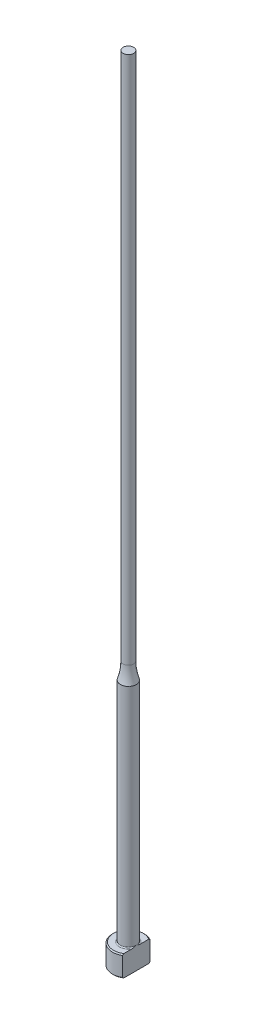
ISO-10303-21;
HEADER;
FILE_DESCRIPTION(('STEP AP214'),'2;1');
FILE_NAME('part.step','',(''),(''),'','','');
FILE_SCHEMA(('AUTOMOTIVE_DESIGN { 1 0 10303 214 1 1 1 1 }'));
ENDSEC;
DATA;
#1=APPLICATION_CONTEXT('core data for automotive mechanical design processes');
#2=APPLICATION_PROTOCOL_DEFINITION('international standard','automotive_design',2000,#1);
#3=PRODUCT_CONTEXT('',#1,'mechanical');
#4=PRODUCT('Part','Part','',(#3));
#5=PRODUCT_RELATED_PRODUCT_CATEGORY('part','',(#4));
#6=PRODUCT_DEFINITION_FORMATION('','',#4);
#7=PRODUCT_DEFINITION_CONTEXT('part definition',#1,'design');
#8=PRODUCT_DEFINITION('design','',#6,#7);
#9=PRODUCT_DEFINITION_SHAPE('','',#8);
#10=(LENGTH_UNIT() NAMED_UNIT(*) SI_UNIT(.MILLI.,.METRE.));
#11=(NAMED_UNIT(*) PLANE_ANGLE_UNIT() SI_UNIT($,.RADIAN.));
#12=(NAMED_UNIT(*) SI_UNIT($,.STERADIAN.) SOLID_ANGLE_UNIT());
#13=UNCERTAINTY_MEASURE_WITH_UNIT(LENGTH_MEASURE(1.E-05),#10,'distance_accuracy_value','');
#14=(GEOMETRIC_REPRESENTATION_CONTEXT(3) GLOBAL_UNCERTAINTY_ASSIGNED_CONTEXT((#13)) GLOBAL_UNIT_ASSIGNED_CONTEXT((#10,
#11,#12)) REPRESENTATION_CONTEXT('',''));
#15=CARTESIAN_POINT('',(0.,0.,0.));
#16=DIRECTION('',(0.,0.,1.));
#17=DIRECTION('',(1.,0.,0.));
#18=AXIS2_PLACEMENT_3D('',#15,#16,#17);
#19=CARTESIAN_POINT('',(-2.99999999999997,4.,0.));
#20=DIRECTION('',(0.,1.,0.));
#21=DIRECTION('',(0.,0.,1.));
#22=AXIS2_PLACEMENT_3D('',#19,#20,#21);
#23=PLANE('',#22);
#24=CARTESIAN_POINT('',(0.,4.,0.));
#25=DIRECTION('',(0.,1.,0.));
#26=DIRECTION('',(0.,0.,1.));
#27=AXIS2_PLACEMENT_3D('',#24,#25,#26);
#28=CIRCLE('',#27,2.79999999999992);
#29=CARTESIAN_POINT('',(1.49999999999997,4.,-2.3643180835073));
#30=VERTEX_POINT('',#29);
#31=CARTESIAN_POINT('',(1.49999999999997,4.,2.3643180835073));
#32=VERTEX_POINT('',#31);
#33=EDGE_CURVE('E187',#30,#32,#28,.T.);
#34=ORIENTED_EDGE('',*,*,#33,.T.);
#35=DIRECTION('',(0.,0.,-1.));
#36=VECTOR('',#35,1.);
#37=CARTESIAN_POINT('',(1.49999999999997,4.,0.));
#38=LINE('',#37,#36);
#39=CARTESIAN_POINT('',(1.49999999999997,3.99999999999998,0.799999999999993));
#40=VERTEX_POINT('',#39);
#41=EDGE_CURVE('E57',#32,#40,#38,.T.);
#42=ORIENTED_EDGE('',*,*,#41,.T.);
#43=CARTESIAN_POINT('',(0.,4.,0.));
#44=DIRECTION('',(0.,1.,0.));
#45=DIRECTION('',(0.,0.,1.));
#46=AXIS2_PLACEMENT_3D('',#43,#44,#45);
#47=CIRCLE('',#46,1.69999999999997);
#48=CARTESIAN_POINT('',(1.49999999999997,3.99999999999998,-0.799999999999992));
#49=VERTEX_POINT('',#48);
#50=EDGE_CURVE('E108',#40,#49,#47,.F.);
#51=ORIENTED_EDGE('',*,*,#50,.T.);
#52=EDGE_CURVE('E137',#49,#30,#38,.T.);
#53=ORIENTED_EDGE('',*,*,#52,.T.);
#54=EDGE_LOOP('',(#34,#42,#51,#53));
#55=FACE_BOUND('',#54,.T.);
#56=ADVANCED_FACE('F32',(#55),#23,.T.);
#57=CARTESIAN_POINT('',(0.,259.958771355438,0.));
#58=DIRECTION('',(0.,1.,0.));
#59=DIRECTION('',(0.,0.,1.));
#60=AXIS2_PLACEMENT_3D('',#57,#58,#59);
#61=CYLINDRICAL_SURFACE('',#60,2.99999999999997);
#62=CARTESIAN_POINT('',(0.,3.79999999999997,0.));
#63=DIRECTION('',(0.,1.,0.));
#64=DIRECTION('',(0.,0.,1.));
#65=AXIS2_PLACEMENT_3D('',#62,#63,#64);
#66=CIRCLE('',#65,2.99999999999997);
#67=CARTESIAN_POINT('',(1.49999999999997,3.79999999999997,2.5980762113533));
#68=VERTEX_POINT('',#67);
#69=CARTESIAN_POINT('',(1.49999999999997,3.79999999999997,-2.5980762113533));
#70=VERTEX_POINT('',#69);
#71=EDGE_CURVE('E105',#68,#70,#66,.F.);
#72=ORIENTED_EDGE('',*,*,#71,.T.);
#73=DIRECTION('',(0.,-1.,0.));
#74=VECTOR('',#73,1.);
#75=CARTESIAN_POINT('',(1.49999999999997,150.,-2.5980762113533));
#76=LINE('',#75,#74);
#77=CARTESIAN_POINT('',(1.49999999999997,0.199999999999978,-2.5980762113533));
#78=VERTEX_POINT('',#77);
#79=EDGE_CURVE('E193',#70,#78,#76,.T.);
#80=ORIENTED_EDGE('',*,*,#79,.T.);
#81=CARTESIAN_POINT('',(0.,0.199999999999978,0.));
#82=DIRECTION('',(0.,-1.,0.));
#83=DIRECTION('',(0.,0.,-1.));
#84=AXIS2_PLACEMENT_3D('',#81,#82,#83);
#85=CIRCLE('',#84,2.99999999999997);
#86=CARTESIAN_POINT('',(1.49999999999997,0.199999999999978,2.5980762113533));
#87=VERTEX_POINT('',#86);
#88=EDGE_CURVE('E100',#78,#87,#85,.F.);
#89=ORIENTED_EDGE('',*,*,#88,.T.);
#90=DIRECTION('',(0.,-1.,0.));
#91=VECTOR('',#90,1.);
#92=CARTESIAN_POINT('',(1.49999999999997,150.,2.5980762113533));
#93=LINE('',#92,#91);
#94=EDGE_CURVE('E93',#68,#87,#93,.T.);
#95=ORIENTED_EDGE('',*,*,#94,.F.);
#96=EDGE_LOOP('',(#72,#80,#89,#95));
#97=FACE_BOUND('',#96,.T.);
#98=ADVANCED_FACE('F158',(#97),#61,.T.);
#99=CARTESIAN_POINT('',(0.,0.,0.));
#100=DIRECTION('',(0.,-1.,0.));
#101=DIRECTION('',(0.,0.,-1.));
#102=AXIS2_PLACEMENT_3D('',#99,#100,#101);
#103=PLANE('',#102);
#104=CARTESIAN_POINT('',(0.,0.,0.));
#105=DIRECTION('',(0.,-1.,0.));
#106=DIRECTION('',(0.,0.,-1.));
#107=AXIS2_PLACEMENT_3D('',#104,#105,#106);
#108=CIRCLE('',#107,2.8);
#109=CARTESIAN_POINT('',(1.49999999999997,0.,2.36431808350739));
#110=VERTEX_POINT('',#109);
#111=CARTESIAN_POINT('',(1.49999999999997,0.,-2.36431808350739));
#112=VERTEX_POINT('',#111);
#113=EDGE_CURVE('E98',#110,#112,#108,.T.);
#114=ORIENTED_EDGE('',*,*,#113,.T.);
#115=DIRECTION('',(0.,0.,1.));
#116=VECTOR('',#115,1.);
#117=CARTESIAN_POINT('',(1.49999999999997,0.,2.5980762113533));
#118=LINE('',#117,#116);
#119=EDGE_CURVE('E83',#112,#110,#118,.T.);
#120=ORIENTED_EDGE('',*,*,#119,.T.);
#121=EDGE_LOOP('',(#114,#120));
#122=FACE_BOUND('',#121,.T.);
#123=ADVANCED_FACE('F103',(#122),#103,.T.);
#124=CARTESIAN_POINT('',(0.,4.,0.));
#125=DIRECTION('',(0.,-1.,0.));
#126=DIRECTION('',(0.,0.,-1.));
#127=AXIS2_PLACEMENT_3D('',#124,#125,#126);
#128=CONICAL_SURFACE('',#127,2.79999999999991,0.7853981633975);
#129=ORIENTED_EDGE('',*,*,#71,.F.);
#130=CARTESIAN_POINT('',(1.49999999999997,0.888258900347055,5.71827621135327));
#131=CARTESIAN_POINT('',(1.49999999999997,1.01361833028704,5.58866816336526));
#132=CARTESIAN_POINT('',(1.49999999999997,1.13884324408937,5.45892957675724));
#133=CARTESIAN_POINT('',(1.49999999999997,1.38894444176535,5.19911365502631));
#134=CARTESIAN_POINT('',(1.49999999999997,1.51382072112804,5.06903631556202));
#135=CARTESIAN_POINT('',(1.49999999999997,1.76320568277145,4.8084018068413));
#136=CARTESIAN_POINT('',(1.49999999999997,1.88771414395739,4.67784442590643));
#137=CARTESIAN_POINT('',(1.49999999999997,2.13618059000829,4.41620813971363));
#138=CARTESIAN_POINT('',(1.49999999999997,2.26013857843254,4.28512923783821));
#139=CARTESIAN_POINT('',(1.49999999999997,2.50488975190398,4.02490837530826));
#140=CARTESIAN_POINT('',(1.49999999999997,2.62569693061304,3.89577958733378));
#141=CARTESIAN_POINT('',(1.49999999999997,2.86640694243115,3.63668213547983));
#142=CARTESIAN_POINT('',(1.49999999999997,2.98630978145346,3.5067134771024));
#143=CARTESIAN_POINT('',(1.49999999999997,3.22486033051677,3.24567921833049));
#144=CARTESIAN_POINT('',(1.49999999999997,3.34350830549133,3.11461386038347));
#145=CARTESIAN_POINT('',(1.49999999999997,3.57907716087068,2.85094268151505));
#146=CARTESIAN_POINT('',(1.49999999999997,3.69599811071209,2.71833692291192));
#147=CARTESIAN_POINT('',(1.49999999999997,3.88262371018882,2.50255231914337));
#148=CARTESIAN_POINT('',(1.49999999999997,3.95312454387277,2.42006293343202));
#149=CARTESIAN_POINT('',(1.49999999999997,4.09287098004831,2.25401084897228));
#150=CARTESIAN_POINT('',(1.49999999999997,4.16211645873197,2.17044804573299));
#151=CARTESIAN_POINT('',(1.49999999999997,4.29964684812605,2.00105967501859));
#152=CARTESIAN_POINT('',(1.49999999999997,4.36791386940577,1.91521952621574));
#153=CARTESIAN_POINT('',(1.49999999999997,4.50205840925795,1.74171392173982));
#154=CARTESIAN_POINT('',(1.49999999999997,4.56793649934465,1.65404891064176));
#155=CARTESIAN_POINT('',(1.49999999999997,4.69728151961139,1.47490236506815));
#156=CARTESIAN_POINT('',(1.49999999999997,4.76069661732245,1.38338308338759));
#157=CARTESIAN_POINT('',(1.49999999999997,4.88239539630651,1.1967566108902));
#158=CARTESIAN_POINT('',(1.49999999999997,4.9406720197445,1.10164473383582));
#159=CARTESIAN_POINT('',(1.49999999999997,5.04841325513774,0.908008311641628));
#160=CARTESIAN_POINT('',(1.49999999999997,5.09797809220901,0.809540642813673));
#161=CARTESIAN_POINT('',(1.49999999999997,5.18432188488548,0.607192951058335));
#162=CARTESIAN_POINT('',(1.49999999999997,5.22114374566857,0.503332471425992));
#163=CARTESIAN_POINT('',(1.49999999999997,5.26099935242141,0.347577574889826));
#164=CARTESIAN_POINT('',(1.49999999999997,5.27157029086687,0.297609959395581));
#165=CARTESIAN_POINT('',(1.49999999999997,5.28794860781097,0.196885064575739));
#166=CARTESIAN_POINT('',(1.49999999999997,5.29375640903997,0.146127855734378));
#167=CARTESIAN_POINT('',(1.49999999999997,5.3001970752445,0.0444388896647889));
#168=CARTESIAN_POINT('',(1.49999999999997,5.3008459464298,-0.00649183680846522));
#169=CARTESIAN_POINT('',(1.49999999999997,5.29696416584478,-0.108155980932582));
#170=CARTESIAN_POINT('',(1.49999999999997,5.29243308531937,-0.158889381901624));
#171=CARTESIAN_POINT('',(1.49999999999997,5.2785691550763,-0.259234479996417));
#172=CARTESIAN_POINT('',(1.49999999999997,5.2692782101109,-0.308852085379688));
#173=CARTESIAN_POINT('',(1.49999999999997,5.24647108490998,-0.40711049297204));
#174=CARTESIAN_POINT('',(1.49999999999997,5.23295324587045,-0.455750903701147));
#175=CARTESIAN_POINT('',(1.49999999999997,5.20226175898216,-0.552149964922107));
#176=CARTESIAN_POINT('',(1.49999999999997,5.18506801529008,-0.5999021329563));
#177=CARTESIAN_POINT('',(1.49999999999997,5.14771387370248,-0.694205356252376));
#178=CARTESIAN_POINT('',(1.49999999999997,5.12755408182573,-0.740756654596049));
#179=CARTESIAN_POINT('',(1.49999999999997,5.06327696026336,-0.879166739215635));
#180=CARTESIAN_POINT('',(1.49999999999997,5.01551721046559,-0.969329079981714));
#181=CARTESIAN_POINT('',(1.49999999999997,4.91367909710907,-1.1460431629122));
#182=CARTESIAN_POINT('',(1.49999999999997,4.85959300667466,-1.23259031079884));
#183=CARTESIAN_POINT('',(1.49999999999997,4.74697968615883,-1.40321348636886));
#184=CARTESIAN_POINT('',(1.49999999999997,4.68843573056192,-1.48727838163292));
#185=CARTESIAN_POINT('',(1.49999999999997,4.56843845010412,-1.6532218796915));
#186=CARTESIAN_POINT('',(1.49999999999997,4.50698656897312,-1.73510153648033));
#187=CARTESIAN_POINT('',(1.49999999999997,4.38115673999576,-1.89829823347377));
#188=CARTESIAN_POINT('',(1.49999999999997,4.31675092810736,-1.9795936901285));
#189=CARTESIAN_POINT('',(1.49999999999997,4.18634068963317,-2.14090082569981));
#190=CARTESIAN_POINT('',(1.49999999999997,4.12033609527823,-2.22091236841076));
#191=CARTESIAN_POINT('',(1.49999999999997,3.92086431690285,-2.45906508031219));
#192=CARTESIAN_POINT('',(1.49999999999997,3.78562663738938,-2.61572090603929));
#193=CARTESIAN_POINT('',(1.49999999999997,3.53554498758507,-2.90006295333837));
#194=CARTESIAN_POINT('',(1.49999999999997,3.42114543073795,-3.02814382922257));
#195=CARTESIAN_POINT('',(1.49999999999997,3.19093557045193,-3.28303767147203));
#196=CARTESIAN_POINT('',(1.49999999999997,3.07512522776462,-3.40985060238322));
#197=CARTESIAN_POINT('',(1.49999999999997,2.72597067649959,-3.78913849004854));
#198=CARTESIAN_POINT('',(1.49999999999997,2.49111760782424,-4.04022177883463));
#199=CARTESIAN_POINT('',(1.49999999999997,2.02882478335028,-4.52992803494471));
#200=CARTESIAN_POINT('',(1.49999999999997,1.80147747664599,-4.76863870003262));
#201=CARTESIAN_POINT('',(1.49999999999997,1.45954865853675,-5.12558036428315));
#202=CARTESIAN_POINT('',(1.49999999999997,1.34548484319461,-5.24430773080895));
#203=CARTESIAN_POINT('',(1.49999999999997,1.11707176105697,-5.48148573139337));
#204=CARTESIAN_POINT('',(1.49999999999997,1.00272249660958,-5.59993636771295));
#205=CARTESIAN_POINT('',(1.49999999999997,0.888258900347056,-5.71827621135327));
#206=B_SPLINE_CURVE_WITH_KNOTS('',3,(#130,#131,#132,#133,#134,#135,#136,#137,#138,#139,#140,
#141,#142,#143,#144,#145,#146,#147,#148,#149,#150,#151,#152,#153,#154,#155,#156,#157,#158,#159,
#160,#161,#162,#163,#164,#165,#166,#167,#168,#169,#170,#171,#172,#173,#174,#175,#176,#177,#178,
#179,#180,#181,#182,#183,#184,#185,#186,#187,#188,#189,#190,#191,#192,#193,#194,#195,#196,#197,
#198,#199,#200,#201,#202,#203,#204,#205),.UNSPECIFIED.,.F.,.F.,(4,2,2,2,2,2,2,2,2,2,2,2,2,2,2,2,
2,2,2,2,2,2,2,2,2,2,2,2,2,2,2,2,2,2,2,2,2,4),(0.,0.540943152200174,1.08189327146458,
1.62312052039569,2.16434426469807,2.69482920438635,3.22531067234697,3.75567781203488,
4.28602356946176,4.61155053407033,4.93710943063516,5.26610945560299,5.59503024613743,
5.92894782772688,6.26331713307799,6.59354403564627,6.92264800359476,7.07567478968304,
7.22868799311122,7.38122626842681,7.53377717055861,7.68500755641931,7.83629736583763,
7.98843643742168,8.14054446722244,8.4461879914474,8.75220879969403,9.05944044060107,
9.366521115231,9.677642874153,9.98879742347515,10.6095925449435,11.1247803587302,
11.6399825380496,12.6713544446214,13.6603005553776,14.1542238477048,14.648143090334),.UNSPECIFIED.);
#207=EDGE_CURVE('E136',#68,#32,#206,.T.);
#208=ORIENTED_EDGE('',*,*,#207,.T.);
#209=ORIENTED_EDGE('',*,*,#33,.F.);
#210=EDGE_CURVE('E128',#30,#70,#206,.T.);
#211=ORIENTED_EDGE('',*,*,#210,.T.);
#212=EDGE_LOOP('',(#129,#208,#209,#211));
#213=FACE_BOUND('',#212,.T.);
#214=ADVANCED_FACE('F144',(#213),#128,.T.);
#215=CARTESIAN_POINT('',(0.,0.199999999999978,0.));
#216=DIRECTION('',(0.,1.,0.));
#217=DIRECTION('',(0.,0.,1.));
#218=AXIS2_PLACEMENT_3D('',#215,#216,#217);
#219=CONICAL_SURFACE('',#218,2.99999999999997,0.785398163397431);
#220=ORIENTED_EDGE('',*,*,#88,.F.);
#221=CARTESIAN_POINT('',(1.49999999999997,3.1117410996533,-5.71827621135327));
#222=CARTESIAN_POINT('',(1.49999999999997,2.98638166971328,-5.58866816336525));
#223=CARTESIAN_POINT('',(1.49999999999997,2.86115675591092,-5.45892957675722));
#224=CARTESIAN_POINT('',(1.49999999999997,2.61105555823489,-5.19911365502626));
#225=CARTESIAN_POINT('',(1.49999999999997,2.48617927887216,-5.06903631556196));
#226=CARTESIAN_POINT('',(1.49999999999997,2.23679431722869,-4.80840180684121));
#227=CARTESIAN_POINT('',(1.49999999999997,2.11228585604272,-4.67784442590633));
#228=CARTESIAN_POINT('',(1.49999999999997,1.86381940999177,-4.4162081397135));
#229=CARTESIAN_POINT('',(1.49999999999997,1.73986142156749,-4.28512923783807));
#230=CARTESIAN_POINT('',(1.49999999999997,1.49511024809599,-4.02490837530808));
#231=CARTESIAN_POINT('',(1.49999999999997,1.3743030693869,-3.8957795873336));
#232=CARTESIAN_POINT('',(1.49999999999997,1.13359305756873,-3.63668213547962));
#233=CARTESIAN_POINT('',(1.49999999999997,1.0136902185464,-3.50671347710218));
#234=CARTESIAN_POINT('',(1.49999999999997,0.77513966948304,-3.24567921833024));
#235=CARTESIAN_POINT('',(1.49999999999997,0.656491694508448,-3.11461386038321));
#236=CARTESIAN_POINT('',(1.49999999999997,0.420922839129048,-2.85094268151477));
#237=CARTESIAN_POINT('',(1.49999999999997,0.30400188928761,-2.71833692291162));
#238=CARTESIAN_POINT('',(1.49999999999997,0.11737628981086,-2.50255231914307));
#239=CARTESIAN_POINT('',(1.49999999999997,0.046875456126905,-2.42006293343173));
#240=CARTESIAN_POINT('',(1.49999999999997,-0.0928709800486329,-2.254010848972));
#241=CARTESIAN_POINT('',(1.49999999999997,-0.162116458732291,-2.17044804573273));
#242=CARTESIAN_POINT('',(1.49999999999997,-0.299646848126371,-2.00105967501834));
#243=CARTESIAN_POINT('',(1.49999999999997,-0.367913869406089,-1.9152195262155));
#244=CARTESIAN_POINT('',(1.49999999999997,-0.502058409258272,-1.7417139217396));
#245=CARTESIAN_POINT('',(1.49999999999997,-0.567936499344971,-1.65404891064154));
#246=CARTESIAN_POINT('',(1.49999999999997,-0.697281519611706,-1.47490236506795));
#247=CARTESIAN_POINT('',(1.49999999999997,-0.76069661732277,-1.38338308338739));
#248=CARTESIAN_POINT('',(1.49999999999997,-0.882395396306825,-1.19675661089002));
#249=CARTESIAN_POINT('',(1.49999999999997,-0.940672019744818,-1.10164473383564));
#250=CARTESIAN_POINT('',(1.49999999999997,-1.04841325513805,-0.908008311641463));
#251=CARTESIAN_POINT('',(1.49999999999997,-1.09797809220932,-0.809540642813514));
#252=CARTESIAN_POINT('',(1.49999999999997,-1.18432188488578,-0.607192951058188));
#253=CARTESIAN_POINT('',(1.49999999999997,-1.22114374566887,-0.50333247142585));
#254=CARTESIAN_POINT('',(1.49999999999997,-1.26099935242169,-0.347577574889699));
#255=CARTESIAN_POINT('',(1.49999999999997,-1.27157029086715,-0.297609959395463));
#256=CARTESIAN_POINT('',(1.49999999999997,-1.28794860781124,-0.196885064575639));
#257=CARTESIAN_POINT('',(1.49999999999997,-1.29375640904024,-0.146127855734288));
#258=CARTESIAN_POINT('',(1.49999999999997,-1.30019707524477,-0.0444388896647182));
#259=CARTESIAN_POINT('',(1.49999999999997,-1.30084594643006,0.00649183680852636));
#260=CARTESIAN_POINT('',(1.49999999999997,-1.29696416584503,0.108155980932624));
#261=CARTESIAN_POINT('',(1.49999999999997,-1.29243308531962,0.158889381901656));
#262=CARTESIAN_POINT('',(1.49999999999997,-1.27856915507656,0.25923447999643));
#263=CARTESIAN_POINT('',(1.49999999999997,-1.26927821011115,0.308852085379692));
#264=CARTESIAN_POINT('',(1.49999999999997,-1.24647108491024,0.407110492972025));
#265=CARTESIAN_POINT('',(1.49999999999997,-1.2329532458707,0.455750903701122));
#266=CARTESIAN_POINT('',(1.49999999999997,-1.20226175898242,0.552149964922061));
#267=CARTESIAN_POINT('',(1.49999999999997,-1.18506801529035,0.599902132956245));
#268=CARTESIAN_POINT('',(1.49999999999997,-1.14771387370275,0.694205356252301));
#269=CARTESIAN_POINT('',(1.49999999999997,-1.12755408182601,0.740756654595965));
#270=CARTESIAN_POINT('',(1.49999999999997,-1.06327696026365,0.879166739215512));
#271=CARTESIAN_POINT('',(1.49999999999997,-1.0155172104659,0.969329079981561));
#272=CARTESIAN_POINT('',(1.49999999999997,-0.913679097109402,1.14604316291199));
#273=CARTESIAN_POINT('',(1.49999999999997,-0.859593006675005,1.2325903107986));
#274=CARTESIAN_POINT('',(1.49999999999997,-0.746979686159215,1.40321348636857));
#275=CARTESIAN_POINT('',(1.49999999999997,-0.688435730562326,1.4872783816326));
#276=CARTESIAN_POINT('',(1.49999999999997,-0.568438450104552,1.65322187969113));
#277=CARTESIAN_POINT('',(1.49999999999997,-0.506986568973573,1.73510153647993));
#278=CARTESIAN_POINT('',(1.49999999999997,-0.381156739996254,1.89829823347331));
#279=CARTESIAN_POINT('',(1.49999999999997,-0.316750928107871,1.97959369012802));
#280=CARTESIAN_POINT('',(1.49999999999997,-0.18634068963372,2.14090082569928));
#281=CARTESIAN_POINT('',(1.49999999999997,-0.120336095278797,2.22091236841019));
#282=CARTESIAN_POINT('',(1.49999999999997,0.0791356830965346,2.45906508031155));
#283=CARTESIAN_POINT('',(1.49999999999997,0.214373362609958,2.61572090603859));
#284=CARTESIAN_POINT('',(1.49999999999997,0.464455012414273,2.90006295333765));
#285=CARTESIAN_POINT('',(1.49999999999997,0.578854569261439,3.02814382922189));
#286=CARTESIAN_POINT('',(1.49999999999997,0.809064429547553,3.28303767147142));
#287=CARTESIAN_POINT('',(1.49999999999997,0.924874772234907,3.40985060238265));
#288=CARTESIAN_POINT('',(1.49999999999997,1.27402932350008,3.78913849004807));
#289=CARTESIAN_POINT('',(1.49999999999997,1.50888239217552,4.04022177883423));
#290=CARTESIAN_POINT('',(1.49999999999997,1.97117521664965,4.52992803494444));
#291=CARTESIAN_POINT('',(1.49999999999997,2.19852252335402,4.76863870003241));
#292=CARTESIAN_POINT('',(1.49999999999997,2.54045134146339,5.12558036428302));
#293=CARTESIAN_POINT('',(1.49999999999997,2.65451515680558,5.24430773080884));
#294=CARTESIAN_POINT('',(1.49999999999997,2.8829282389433,5.48148573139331));
#295=CARTESIAN_POINT('',(1.49999999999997,2.99727750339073,5.59993636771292));
#296=CARTESIAN_POINT('',(1.49999999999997,3.1117410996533,5.71827621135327));
#297=B_SPLINE_CURVE_WITH_KNOTS('',3,(#221,#222,#223,#224,#225,#226,#227,#228,#229,#230,#231,
#232,#233,#234,#235,#236,#237,#238,#239,#240,#241,#242,#243,#244,#245,#246,#247,#248,#249,#250,
#251,#252,#253,#254,#255,#256,#257,#258,#259,#260,#261,#262,#263,#264,#265,#266,#267,#268,#269,
#270,#271,#272,#273,#274,#275,#276,#277,#278,#279,#280,#281,#282,#283,#284,#285,#286,#287,#288,
#289,#290,#291,#292,#293,#294,#295,#296),.UNSPECIFIED.,.F.,.F.,(4,2,2,2,2,2,2,2,2,2,2,2,2,2,2,2,
2,2,2,2,2,2,2,2,2,2,2,2,2,2,2,2,2,2,2,2,2,4),(0.,0.540943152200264,1.08189327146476,
1.62312052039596,2.16434426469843,2.69482920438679,3.22531067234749,3.75567781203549,
4.28602356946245,4.611550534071,4.9371094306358,5.26610945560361,5.59503024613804,
5.92894782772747,6.26331713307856,6.59354403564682,6.92264800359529,7.07567478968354,
7.22868799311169,7.38122626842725,7.53377717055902,7.6850075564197,7.83629736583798,
7.98843643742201,8.14054446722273,8.44618799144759,8.75220879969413,9.05944044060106,
9.3665211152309,9.6776428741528,9.98879742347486,10.609592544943,11.1247803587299,
11.6399825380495,12.6713544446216,13.6603005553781,14.1542238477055,14.6481430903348),.UNSPECIFIED.);
#298=EDGE_CURVE('E86',#78,#112,#297,.T.);
#299=ORIENTED_EDGE('',*,*,#298,.T.);
#300=ORIENTED_EDGE('',*,*,#113,.F.);
#301=EDGE_CURVE('E89',#110,#87,#297,.T.);
#302=ORIENTED_EDGE('',*,*,#301,.T.);
#303=EDGE_LOOP('',(#220,#299,#300,#302));
#304=FACE_BOUND('',#303,.T.);
#305=ADVANCED_FACE('F97',(#304),#219,.T.);
#306=CARTESIAN_POINT('',(0.,4.19999999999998,0.));
#307=DIRECTION('',(0.,1.,0.));
#308=DIRECTION('',(0.,0.,1.));
#309=AXIS2_PLACEMENT_3D('',#306,#307,#308);
#310=TOROIDAL_SURFACE('',#309,1.69999999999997,0.2);
#311=CARTESIAN_POINT('',(1.49999999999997,4.19999999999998,0.));
#312=CARTESIAN_POINT('',(1.49999999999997,4.20000050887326,7.14686674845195E-11));
#313=CARTESIAN_POINT('',(1.49999999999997,4.20000101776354,-1.21663673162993E-07));
#314=CARTESIAN_POINT('',(1.49999999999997,4.20000199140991,-4.97616237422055E-07));
#315=CARTESIAN_POINT('',(1.49999999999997,4.20000245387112,-7.56516220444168E-07));
#316=CARTESIAN_POINT('',(1.49999999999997,4.20000338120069,-1.37642837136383E-06));
#317=CARTESIAN_POINT('',(1.49999999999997,4.20000384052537,-1.74563476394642E-06));
#318=CARTESIAN_POINT('',(1.49999999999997,4.20000469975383,-2.53565984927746E-06));
#319=CARTESIAN_POINT('',(1.49999999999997,4.20000510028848,-2.95582597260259E-06));
#320=CARTESIAN_POINT('',(1.49999999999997,4.20000646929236,-4.48430445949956E-06));
#321=CARTESIAN_POINT('',(1.49999999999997,4.20000736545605,-5.6586103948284E-06));
#322=CARTESIAN_POINT('',(1.49999999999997,4.20000893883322,-8.06479202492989E-06));
#323=CARTESIAN_POINT('',(1.49999999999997,4.20000962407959,-9.29170517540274E-06));
#324=CARTESIAN_POINT('',(1.49999999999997,4.20001225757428,-1.416232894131E-05));
#325=CARTESIAN_POINT('',(1.49999999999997,4.20001407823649,-1.78790031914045E-05));
#326=CARTESIAN_POINT('',(1.49999999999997,4.20001699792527,-2.51443066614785E-05));
#327=CARTESIAN_POINT('',(1.49999999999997,4.20001815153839,-2.86715394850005E-05));
#328=CARTESIAN_POINT('',(1.49999999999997,4.20002315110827,-4.39218128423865E-05));
#329=CARTESIAN_POINT('',(1.49999999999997,4.20002701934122,-5.56288390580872E-05));
#330=CARTESIAN_POINT('',(1.49999999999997,4.20003312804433,-7.7405829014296E-05));
#331=CARTESIAN_POINT('',(1.49999999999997,4.20003553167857,-8.74278412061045E-05));
#332=CARTESIAN_POINT('',(1.49999999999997,4.20005483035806,-0.000161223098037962));
#333=CARTESIAN_POINT('',(1.49999999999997,4.20007979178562,-0.000222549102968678));
#334=CARTESIAN_POINT('',(1.49999999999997,4.20017391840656,-0.000462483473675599));
#335=CARTESIAN_POINT('',(1.49999999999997,4.20023706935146,-0.000642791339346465));
#336=CARTESIAN_POINT('',(1.49999999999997,4.20048761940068,-0.00134785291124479));
#337=CARTESIAN_POINT('',(1.49999999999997,4.20068132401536,-0.00187087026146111));
#338=CARTESIAN_POINT('',(1.49999999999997,4.20147357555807,-0.00402004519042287));
#339=CARTESIAN_POINT('',(1.49999999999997,4.20206499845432,-0.0056481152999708));
#340=CARTESIAN_POINT('',(1.49999999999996,4.20892634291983,-0.0245232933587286));
#341=CARTESIAN_POINT('',(1.49999999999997,4.21523683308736,-0.041759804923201));
#342=CARTESIAN_POINT('',(1.49999999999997,4.22755028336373,-0.0756091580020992));
#343=CARTESIAN_POINT('',(1.49999999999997,4.23355589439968,-0.0922211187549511));
#344=CARTESIAN_POINT('',(1.49999999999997,4.24620101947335,-0.127454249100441));
#345=CARTESIAN_POINT('',(1.49999999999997,4.25283080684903,-0.146078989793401));
#346=CARTESIAN_POINT('',(1.49999999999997,4.26599765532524,-0.183577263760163));
#347=CARTESIAN_POINT('',(1.49999999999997,4.27253305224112,-0.202451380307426));
#348=CARTESIAN_POINT('',(1.49999999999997,4.28834228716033,-0.248982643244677));
#349=CARTESIAN_POINT('',(1.49999999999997,4.2974915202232,-0.276682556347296));
#350=CARTESIAN_POINT('',(1.49999999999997,4.31490935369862,-0.331625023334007));
#351=CARTESIAN_POINT('',(1.49999999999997,4.3231938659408,-0.358862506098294));
#352=CARTESIAN_POINT('',(1.49999999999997,4.34051594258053,-0.419125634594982));
#353=CARTESIAN_POINT('',(1.49999999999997,4.34936607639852,-0.452206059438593));
#354=CARTESIAN_POINT('',(1.49999999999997,4.36549583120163,-0.519023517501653));
#355=CARTESIAN_POINT('',(1.49999999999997,4.37276283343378,-0.552763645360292));
#356=CARTESIAN_POINT('',(1.49999999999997,4.38554755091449,-0.62305310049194));
#357=CARTESIAN_POINT('',(1.49999999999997,4.39090573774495,-0.65963271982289));
#358=CARTESIAN_POINT('',(1.49999999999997,4.39825016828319,-0.733028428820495));
#359=CARTESIAN_POINT('',(1.49999999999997,4.40024734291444,-0.76984335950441));
#360=CARTESIAN_POINT('',(1.49999999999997,4.39970780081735,-0.842856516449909));
#361=CARTESIAN_POINT('',(1.49999999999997,4.39725347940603,-0.879053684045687));
#362=CARTESIAN_POINT('',(1.49999999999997,4.38900085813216,-0.93238076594));
#363=CARTESIAN_POINT('',(1.49999999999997,4.38553049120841,-0.949868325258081));
#364=CARTESIAN_POINT('',(1.49999999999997,4.37678336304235,-0.984374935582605));
#365=CARTESIAN_POINT('',(1.49999999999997,4.37150943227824,-1.00139467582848));
#366=CARTESIAN_POINT('',(1.49999999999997,4.35869781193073,-1.03479423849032));
#367=CARTESIAN_POINT('',(1.49999999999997,4.3511359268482,-1.05116499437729));
#368=CARTESIAN_POINT('',(1.49999999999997,4.33325333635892,-1.08234828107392));
#369=CARTESIAN_POINT('',(1.49999999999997,4.32294266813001,-1.09716621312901));
#370=CARTESIAN_POINT('',(1.49999999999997,4.30512758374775,-1.11714173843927));
#371=CARTESIAN_POINT('',(1.49999999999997,4.29884721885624,-1.12339066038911));
#372=CARTESIAN_POINT('',(1.49999999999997,4.28545950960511,-1.13494695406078));
#373=CARTESIAN_POINT('',(1.49999999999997,4.27835226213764,-1.14025443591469));
#374=CARTESIAN_POINT('',(1.49999999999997,4.26325970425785,-1.14967631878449));
#375=CARTESIAN_POINT('',(1.49999999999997,4.25526534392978,-1.15377649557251));
#376=CARTESIAN_POINT('',(1.49999999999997,4.23863207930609,-1.16034952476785));
#377=CARTESIAN_POINT('',(1.49999999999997,4.22999427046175,-1.16282507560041));
#378=CARTESIAN_POINT('',(1.49999999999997,4.21343922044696,-1.16570267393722));
#379=CARTESIAN_POINT('',(1.49999999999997,4.20555896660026,-1.16631687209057));
#380=CARTESIAN_POINT('',(1.49999999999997,4.18982775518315,-1.16602054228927));
#381=CARTESIAN_POINT('',(1.49999999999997,4.18197679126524,-1.16511036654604));
#382=CARTESIAN_POINT('',(1.49999999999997,4.16747846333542,-1.16204446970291));
#383=CARTESIAN_POINT('',(1.49999999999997,4.16079696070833,-1.16004509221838));
#384=CARTESIAN_POINT('',(1.49999999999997,4.14781700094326,-1.15505972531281));
#385=CARTESIAN_POINT('',(1.49999999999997,4.14151862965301,-1.1520735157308));
#386=CARTESIAN_POINT('',(1.49999999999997,4.12690214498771,-1.14387585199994));
#387=CARTESIAN_POINT('',(1.49999999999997,4.11881436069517,-1.13825400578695));
#388=CARTESIAN_POINT('',(1.49999999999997,4.1036444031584,-1.12578441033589));
#389=CARTESIAN_POINT('',(1.49999999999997,4.09656475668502,-1.11893367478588));
#390=CARTESIAN_POINT('',(1.49999999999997,4.08012297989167,-1.10074342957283));
#391=CARTESIAN_POINT('',(1.49999999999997,4.07136543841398,-1.08886044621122));
#392=CARTESIAN_POINT('',(1.49999999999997,4.05578194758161,-1.06392743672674));
#393=CARTESIAN_POINT('',(1.49999999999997,4.0489571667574,-1.05087671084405));
#394=CARTESIAN_POINT('',(1.49999999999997,4.03273856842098,-1.01472307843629));
#395=CARTESIAN_POINT('',(1.49999999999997,4.02486230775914,-0.990945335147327));
#396=CARTESIAN_POINT('',(1.49999999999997,4.01257693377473,-0.94232199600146));
#397=CARTESIAN_POINT('',(1.49999999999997,4.00820590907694,-0.917467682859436));
#398=CARTESIAN_POINT('',(1.49999999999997,4.00229956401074,-0.867912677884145));
#399=CARTESIAN_POINT('',(1.49999999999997,4.0007128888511,-0.843217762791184));
#400=CARTESIAN_POINT('',(1.49999999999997,3.9996723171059,-0.79374605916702));
#401=CARTESIAN_POINT('',(1.49999999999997,4.0002230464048,-0.768969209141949));
#402=CARTESIAN_POINT('',(1.49999999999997,4.00433101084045,-0.696994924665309));
#403=CARTESIAN_POINT('',(1.49999999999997,4.01016976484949,-0.64993124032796));
#404=CARTESIAN_POINT('',(1.49999999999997,4.02567776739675,-0.559166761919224));
#405=CARTESIAN_POINT('',(1.49999999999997,4.03511950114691,-0.515423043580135));
#406=CARTESIAN_POINT('',(1.49999999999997,4.05693059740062,-0.427590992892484));
#407=CARTESIAN_POINT('',(1.49999999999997,4.06936356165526,-0.383518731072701));
#408=CARTESIAN_POINT('',(1.49999999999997,4.09174953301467,-0.310161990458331));
#409=CARTESIAN_POINT('',(1.49999999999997,4.10119843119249,-0.280718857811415));
#410=CARTESIAN_POINT('',(1.49999999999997,4.12060442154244,-0.22234098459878));
#411=CARTESIAN_POINT('',(1.49999999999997,4.13055519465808,-0.193404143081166));
#412=CARTESIAN_POINT('',(1.49999999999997,4.14973721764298,-0.138756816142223));
#413=CARTESIAN_POINT('',(1.49999999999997,4.15893123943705,-0.113033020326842));
#414=CARTESIAN_POINT('',(1.49999999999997,4.17788037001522,-0.0606351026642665));
#415=CARTESIAN_POINT('',(1.49999999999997,4.18764328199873,-0.0339636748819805));
#416=CARTESIAN_POINT('',(1.49999999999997,4.19793548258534,-0.00564657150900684));
#417=CARTESIAN_POINT('',(1.49999999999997,4.19852751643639,-0.00401699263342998));
#418=CARTESIAN_POINT('',(1.49999999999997,4.1993199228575,-0.0018674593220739));
#419=CARTESIAN_POINT('',(1.49999999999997,4.19951319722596,-0.00134559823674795));
#420=CARTESIAN_POINT('',(1.49999999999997,4.19976322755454,-0.000641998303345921));
#421=CARTESIAN_POINT('',(1.49999999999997,4.19982627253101,-0.000461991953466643));
#422=CARTESIAN_POINT('',(1.49999999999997,4.19992025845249,-0.000222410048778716));
#423=CARTESIAN_POINT('',(1.49999999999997,4.19994519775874,-0.000161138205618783));
#424=CARTESIAN_POINT('',(1.49999999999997,4.19996448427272,-8.74039267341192E-05));
#425=CARTESIAN_POINT('',(1.49999999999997,4.19996688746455,-7.73857556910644E-05));
#426=CARTESIAN_POINT('',(1.49999999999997,4.1999729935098,-5.56173272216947E-05));
#427=CARTESIAN_POINT('',(1.49999999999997,4.19997685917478,-4.39149186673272E-05));
#428=CARTESIAN_POINT('',(1.49999999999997,4.19998185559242,-2.86698156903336E-05));
#429=CARTESIAN_POINT('',(1.49999999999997,4.19998300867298,-2.51431575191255E-05));
#430=CARTESIAN_POINT('',(1.49999999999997,4.19998592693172,-1.78789552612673E-05));
#431=CARTESIAN_POINT('',(1.49999999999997,4.19998774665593,-1.41627846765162E-05));
#432=CARTESIAN_POINT('',(1.49999999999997,4.19999037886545,-9.29264488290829E-06));
#433=CARTESIAN_POINT('',(1.49999999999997,4.19999106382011,-8.06577599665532E-06));
#434=CARTESIAN_POINT('',(1.49999999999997,4.19999263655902,-5.65962639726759E-06));
#435=CARTESIAN_POINT('',(1.49999999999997,4.19999353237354,-4.48530466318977E-06));
#436=CARTESIAN_POINT('',(1.49999999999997,4.19999490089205,-2.95673740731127E-06));
#437=CARTESIAN_POINT('',(1.49999999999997,4.1999953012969,-2.53653208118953E-06));
#438=CARTESIAN_POINT('',(1.49999999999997,4.19999616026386,-1.74640525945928E-06));
#439=CARTESIAN_POINT('',(1.49999999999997,4.19999661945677,-1.37713598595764E-06));
#440=CARTESIAN_POINT('',(1.49999999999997,4.19999754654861,-7.57072336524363E-07));
#441=CARTESIAN_POINT('',(1.49999999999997,4.19999800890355,-4.9808738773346E-07));
#442=CARTESIAN_POINT('',(1.49999999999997,4.19999898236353,-1.21927249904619E-07));
#443=CARTESIAN_POINT('',(1.49999999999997,4.19999949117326,-7.14621294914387E-11));
#444=CARTESIAN_POINT('',(1.49999999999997,4.19999999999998,0.));
#445=B_SPLINE_CURVE_WITH_KNOTS('',3,(#311,#312,#313,#314,#315,#316,#317,#318,#319,#320,#321,
#322,#323,#324,#325,#326,#327,#328,#329,#330,#331,#332,#333,#334,#335,#336,#337,#338,#339,#340,
#341,#342,#343,#344,#345,#346,#347,#348,#349,#350,#351,#352,#353,#354,#355,#356,#357,#358,#359,
#360,#361,#362,#363,#364,#365,#366,#367,#368,#369,#370,#371,#372,#373,#374,#375,#376,#377,#378,
#379,#380,#381,#382,#383,#384,#385,#386,#387,#388,#389,#390,#391,#392,#393,#394,#395,#396,#397,
#398,#399,#400,#401,#402,#403,#404,#405,#406,#407,#408,#409,#410,#411,#412,#413,#414,#415,#416,
#417,#418,#419,#420,#421,#422,#423,#424,#425,#426,#427,#428,#429,#430,#431,#432,#433,#434,#435,
#436,#437,#438,#439,#440,#441,#442,#443,#444),.UNSPECIFIED.,.T.,.F.,(4,2,2,2,2,2,2,2,2,2,2,2,2,
2,2,2,2,2,2,2,2,2,2,2,2,2,2,2,2,2,2,2,2,2,2,2,2,2,2,2,2,2,2,2,2,2,2,2,2,2,2,2,2,2,2,2,2,2,2,2,2,
2,2,2,2,2,4),(0.,1.5268750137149E-06,3.10959387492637E-06,4.86976756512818E-06,
6.60940084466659E-06,1.10202525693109E-05,1.5232779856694E-05,2.7614037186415E-05,
3.87351645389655E-05,7.57188332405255E-05,0.000106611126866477,0.000304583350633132,
0.00087827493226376,0.00255078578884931,0.0077480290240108,0.0628090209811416,0.115802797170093,
0.175110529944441,0.23503061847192,0.32253950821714,0.407938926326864,0.510638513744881,
0.614128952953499,0.724918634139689,0.835347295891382,0.943752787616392,0.997165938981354,
1.05049564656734,1.10441029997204,1.15813071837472,1.18463966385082,1.21114550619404,
1.23795217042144,1.26471419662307,1.2882832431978,1.31184684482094,1.33268332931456,
1.35352446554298,1.38290826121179,1.41236445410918,1.45639976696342,1.50046164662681,
1.57518788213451,1.65071550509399,1.72483484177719,1.79911468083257,1.94105061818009,
2.07520625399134,2.2125154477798,2.30527614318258,2.39707056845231,2.47902409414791,
2.56422207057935,2.56942417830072,2.57109299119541,2.57166572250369,2.57186352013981,
2.57189440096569,2.57193136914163,2.57194248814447,2.57195486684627,2.57195907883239,
2.57196348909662,2.57196522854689,2.57196698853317,2.57196857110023,2.57197009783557),.UNSPECIFIED.);
#446=CARTESIAN_POINT('',(1.49999999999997,4.19999999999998,0.));
#447=VERTEX_POINT('',#446);
#448=EDGE_CURVE('E11',#49,#447,#445,.T.);
#449=ORIENTED_EDGE('',*,*,#448,.F.);
#450=ORIENTED_EDGE('',*,*,#50,.F.);
#451=CARTESIAN_POINT('',(1.49999999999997,4.19999999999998,0.));
#452=CARTESIAN_POINT('',(1.49999999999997,4.1999994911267,-7.1468641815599E-11));
#453=CARTESIAN_POINT('',(1.49999999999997,4.19999898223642,1.21663673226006E-07));
#454=CARTESIAN_POINT('',(1.49999999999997,4.19999800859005,4.97616237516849E-07));
#455=CARTESIAN_POINT('',(1.49999999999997,4.19999754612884,7.56516220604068E-07));
#456=CARTESIAN_POINT('',(1.49999999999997,4.19999661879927,1.37642837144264E-06));
#457=CARTESIAN_POINT('',(1.49999999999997,4.1999961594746,1.74563476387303E-06));
#458=CARTESIAN_POINT('',(1.49999999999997,4.19999530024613,2.5356598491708E-06));
#459=CARTESIAN_POINT('',(1.49999999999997,4.19999489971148,2.95582597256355E-06));
#460=CARTESIAN_POINT('',(1.49999999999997,4.1999935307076,4.48430445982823E-06));
#461=CARTESIAN_POINT('',(1.49999999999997,4.19999263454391,5.6586103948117E-06));
#462=CARTESIAN_POINT('',(1.49999999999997,4.19999106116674,8.06479202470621E-06));
#463=CARTESIAN_POINT('',(1.49999999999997,4.19999037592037,9.29170517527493E-06));
#464=CARTESIAN_POINT('',(1.49999999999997,4.19998774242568,1.41623289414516E-05));
#465=CARTESIAN_POINT('',(1.49999999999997,4.19998592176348,1.78790031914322E-05));
#466=CARTESIAN_POINT('',(1.49999999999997,4.1999830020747,2.51443066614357E-05));
#467=CARTESIAN_POINT('',(1.49999999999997,4.19998184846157,2.86715394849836E-05));
#468=CARTESIAN_POINT('',(1.49999999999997,4.1999768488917,4.39218128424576E-05));
#469=CARTESIAN_POINT('',(1.49999999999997,4.19997298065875,5.56288390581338E-05));
#470=CARTESIAN_POINT('',(1.49999999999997,4.19996687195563,7.7405829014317E-05));
#471=CARTESIAN_POINT('',(1.49999999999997,4.19996446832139,8.74278412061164E-05));
#472=CARTESIAN_POINT('',(1.49999999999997,4.1999451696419,0.000161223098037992));
#473=CARTESIAN_POINT('',(1.49999999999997,4.19992020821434,0.000222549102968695));
#474=CARTESIAN_POINT('',(1.49999999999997,4.19982608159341,0.000462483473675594));
#475=CARTESIAN_POINT('',(1.49999999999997,4.1997629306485,0.000642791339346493));
#476=CARTESIAN_POINT('',(1.49999999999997,4.19951238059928,0.00134785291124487));
#477=CARTESIAN_POINT('',(1.49999999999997,4.19931867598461,0.00187087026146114));
#478=CARTESIAN_POINT('',(1.49999999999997,4.19852642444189,0.00402004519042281));
#479=CARTESIAN_POINT('',(1.49999999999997,4.19793500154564,0.00564811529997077));
#480=CARTESIAN_POINT('',(1.49999999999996,4.19107365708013,0.0245232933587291));
#481=CARTESIAN_POINT('',(1.49999999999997,4.1847631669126,0.0417598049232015));
#482=CARTESIAN_POINT('',(1.49999999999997,4.17244971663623,0.0756091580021));
#483=CARTESIAN_POINT('',(1.49999999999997,4.16644410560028,0.0922211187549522));
#484=CARTESIAN_POINT('',(1.49999999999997,4.15379898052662,0.127454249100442));
#485=CARTESIAN_POINT('',(1.49999999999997,4.14716919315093,0.146078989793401));
#486=CARTESIAN_POINT('',(1.49999999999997,4.13400234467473,0.183577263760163));
#487=CARTESIAN_POINT('',(1.49999999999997,4.12746694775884,0.202451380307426));
#488=CARTESIAN_POINT('',(1.49999999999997,4.11165771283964,0.248982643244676));
#489=CARTESIAN_POINT('',(1.49999999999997,4.10250847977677,0.276682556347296));
#490=CARTESIAN_POINT('',(1.49999999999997,4.08509064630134,0.331625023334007));
#491=CARTESIAN_POINT('',(1.49999999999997,4.07680613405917,0.358862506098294));
#492=CARTESIAN_POINT('',(1.49999999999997,4.05948405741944,0.419125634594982));
#493=CARTESIAN_POINT('',(1.49999999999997,4.05063392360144,0.452206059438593));
#494=CARTESIAN_POINT('',(1.49999999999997,4.03450416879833,0.519023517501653));
#495=CARTESIAN_POINT('',(1.49999999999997,4.02723716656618,0.552763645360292));
#496=CARTESIAN_POINT('',(1.49999999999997,4.01445244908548,0.62305310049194));
#497=CARTESIAN_POINT('',(1.49999999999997,4.00909426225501,0.659632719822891));
#498=CARTESIAN_POINT('',(1.49999999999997,4.00174983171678,0.733028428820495));
#499=CARTESIAN_POINT('',(1.49999999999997,3.99975265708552,0.76984335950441));
#500=CARTESIAN_POINT('',(1.49999999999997,4.00029219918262,0.842856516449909));
#501=CARTESIAN_POINT('',(1.49999999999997,4.00274652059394,0.879053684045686));
#502=CARTESIAN_POINT('',(1.49999999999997,4.0109991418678,0.93238076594));
#503=CARTESIAN_POINT('',(1.49999999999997,4.01446950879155,0.949868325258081));
#504=CARTESIAN_POINT('',(1.49999999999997,4.02321663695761,0.984374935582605));
#505=CARTESIAN_POINT('',(1.49999999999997,4.02849056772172,1.00139467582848));
#506=CARTESIAN_POINT('',(1.49999999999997,4.04130218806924,1.03479423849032));
#507=CARTESIAN_POINT('',(1.49999999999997,4.04886407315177,1.05116499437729));
#508=CARTESIAN_POINT('',(1.49999999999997,4.06674666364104,1.08234828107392));
#509=CARTESIAN_POINT('',(1.49999999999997,4.07705733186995,1.09716621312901));
#510=CARTESIAN_POINT('',(1.49999999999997,4.09487241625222,1.11714173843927));
#511=CARTESIAN_POINT('',(1.49999999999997,4.10115278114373,1.12339066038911));
#512=CARTESIAN_POINT('',(1.49999999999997,4.11454049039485,1.13494695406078));
#513=CARTESIAN_POINT('',(1.49999999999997,4.12164773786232,1.14025443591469));
#514=CARTESIAN_POINT('',(1.49999999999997,4.13674029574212,1.14967631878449));
#515=CARTESIAN_POINT('',(1.49999999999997,4.14473465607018,1.15377649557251));
#516=CARTESIAN_POINT('',(1.49999999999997,4.16136792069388,1.16034952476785));
#517=CARTESIAN_POINT('',(1.49999999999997,4.17000572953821,1.16282507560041));
#518=CARTESIAN_POINT('',(1.49999999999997,4.186560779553,1.16570267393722));
#519=CARTESIAN_POINT('',(1.49999999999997,4.1944410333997,1.16631687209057));
#520=CARTESIAN_POINT('',(1.49999999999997,4.21017224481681,1.16602054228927));
#521=CARTESIAN_POINT('',(1.49999999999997,4.21802320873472,1.16511036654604));
#522=CARTESIAN_POINT('',(1.49999999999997,4.23252153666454,1.16204446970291));
#523=CARTESIAN_POINT('',(1.49999999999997,4.23920303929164,1.16004509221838));
#524=CARTESIAN_POINT('',(1.49999999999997,4.2521829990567,1.15505972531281));
#525=CARTESIAN_POINT('',(1.49999999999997,4.25848137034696,1.1520735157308));
#526=CARTESIAN_POINT('',(1.49999999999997,4.27309785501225,1.14387585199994));
#527=CARTESIAN_POINT('',(1.49999999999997,4.28118563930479,1.13825400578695));
#528=CARTESIAN_POINT('',(1.49999999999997,4.29635559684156,1.12578441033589));
#529=CARTESIAN_POINT('',(1.49999999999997,4.30343524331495,1.11893367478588));
#530=CARTESIAN_POINT('',(1.49999999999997,4.31987702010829,1.10074342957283));
#531=CARTESIAN_POINT('',(1.49999999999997,4.32863456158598,1.08886044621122));
#532=CARTESIAN_POINT('',(1.49999999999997,4.34421805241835,1.06392743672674));
#533=CARTESIAN_POINT('',(1.49999999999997,4.35104283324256,1.05087671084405));
#534=CARTESIAN_POINT('',(1.49999999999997,4.36726143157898,1.01472307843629));
#535=CARTESIAN_POINT('',(1.49999999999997,4.37513769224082,0.990945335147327));
#536=CARTESIAN_POINT('',(1.49999999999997,4.38742306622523,0.94232199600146));
#537=CARTESIAN_POINT('',(1.49999999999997,4.39179409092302,0.917467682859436));
#538=CARTESIAN_POINT('',(1.49999999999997,4.39770043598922,0.867912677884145));
#539=CARTESIAN_POINT('',(1.49999999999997,4.39928711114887,0.843217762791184));
#540=CARTESIAN_POINT('',(1.49999999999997,4.40032768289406,0.79374605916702));
#541=CARTESIAN_POINT('',(1.49999999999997,4.39977695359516,0.768969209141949));
#542=CARTESIAN_POINT('',(1.49999999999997,4.39566898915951,0.696994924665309));
#543=CARTESIAN_POINT('',(1.49999999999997,4.38983023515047,0.64993124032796));
#544=CARTESIAN_POINT('',(1.49999999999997,4.37432223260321,0.559166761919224));
#545=CARTESIAN_POINT('',(1.49999999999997,4.36488049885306,0.515423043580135));
#546=CARTESIAN_POINT('',(1.49999999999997,4.34306940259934,0.427590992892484));
#547=CARTESIAN_POINT('',(1.49999999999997,4.33063643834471,0.383518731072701));
#548=CARTESIAN_POINT('',(1.49999999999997,4.30825046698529,0.310161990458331));
#549=CARTESIAN_POINT('',(1.49999999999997,4.29880156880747,0.280718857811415));
#550=CARTESIAN_POINT('',(1.49999999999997,4.27939557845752,0.22234098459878));
#551=CARTESIAN_POINT('',(1.49999999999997,4.26944480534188,0.193404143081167));
#552=CARTESIAN_POINT('',(1.49999999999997,4.25026278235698,0.138756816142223));
#553=CARTESIAN_POINT('',(1.49999999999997,4.24106876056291,0.113033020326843));
#554=CARTESIAN_POINT('',(1.49999999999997,4.22211962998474,0.0606351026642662));
#555=CARTESIAN_POINT('',(1.49999999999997,4.21235671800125,0.0339636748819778));
#556=CARTESIAN_POINT('',(1.49999999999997,4.20206451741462,0.00564657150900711));
#557=CARTESIAN_POINT('',(1.49999999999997,4.20147248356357,0.00401699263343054));
#558=CARTESIAN_POINT('',(1.49999999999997,4.20068007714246,0.00186745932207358));
#559=CARTESIAN_POINT('',(1.49999999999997,4.200486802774,0.00134559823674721));
#560=CARTESIAN_POINT('',(1.49999999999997,4.20023677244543,0.000641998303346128));
#561=CARTESIAN_POINT('',(1.49999999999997,4.20017372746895,0.000461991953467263));
#562=CARTESIAN_POINT('',(1.49999999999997,4.20007974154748,0.000222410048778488));
#563=CARTESIAN_POINT('',(1.49999999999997,4.20005480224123,0.000161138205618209));
#564=CARTESIAN_POINT('',(1.49999999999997,4.20003551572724,8.74039267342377E-05));
#565=CARTESIAN_POINT('',(1.49999999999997,4.20003311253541,7.73857556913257E-05));
#566=CARTESIAN_POINT('',(1.49999999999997,4.20002700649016,5.56173272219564E-05));
#567=CARTESIAN_POINT('',(1.49999999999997,4.20002314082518,4.39149186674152E-05));
#568=CARTESIAN_POINT('',(1.49999999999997,4.20001814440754,2.86698156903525E-05));
#569=CARTESIAN_POINT('',(1.49999999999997,4.20001699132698,2.51431575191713E-05));
#570=CARTESIAN_POINT('',(1.49999999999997,4.20001407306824,1.78789552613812E-05));
#571=CARTESIAN_POINT('',(1.49999999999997,4.20001225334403,1.41627846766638E-05));
#572=CARTESIAN_POINT('',(1.49999999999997,4.20000962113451,9.29264488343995E-06));
#573=CARTESIAN_POINT('',(1.49999999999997,4.20000893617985,8.06577599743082E-06));
#574=CARTESIAN_POINT('',(1.49999999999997,4.20000736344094,5.65962639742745E-06));
#575=CARTESIAN_POINT('',(1.49999999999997,4.20000646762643,4.4853046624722E-06));
#576=CARTESIAN_POINT('',(1.49999999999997,4.20000509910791,2.95673740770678E-06));
#577=CARTESIAN_POINT('',(1.49999999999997,4.20000469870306,2.53653208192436E-06));
#578=CARTESIAN_POINT('',(1.49999999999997,4.2000038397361,1.74640526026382E-06));
#579=CARTESIAN_POINT('',(1.49999999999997,4.20000338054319,1.37713598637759E-06));
#580=CARTESIAN_POINT('',(1.49999999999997,4.20000245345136,7.5707233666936E-07));
#581=CARTESIAN_POINT('',(1.49999999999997,4.20000199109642,4.98087387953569E-07));
#582=CARTESIAN_POINT('',(1.49999999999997,4.20000101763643,1.2192725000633E-07));
#583=CARTESIAN_POINT('',(1.49999999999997,4.20000050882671,7.14621038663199E-11));
#584=CARTESIAN_POINT('',(1.49999999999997,4.19999999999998,0.));
#585=B_SPLINE_CURVE_WITH_KNOTS('',3,(#451,#452,#453,#454,#455,#456,#457,#458,#459,#460,#461,
#462,#463,#464,#465,#466,#467,#468,#469,#470,#471,#472,#473,#474,#475,#476,#477,#478,#479,#480,
#481,#482,#483,#484,#485,#486,#487,#488,#489,#490,#491,#492,#493,#494,#495,#496,#497,#498,#499,
#500,#501,#502,#503,#504,#505,#506,#507,#508,#509,#510,#511,#512,#513,#514,#515,#516,#517,#518,
#519,#520,#521,#522,#523,#524,#525,#526,#527,#528,#529,#530,#531,#532,#533,#534,#535,#536,#537,
#538,#539,#540,#541,#542,#543,#544,#545,#546,#547,#548,#549,#550,#551,#552,#553,#554,#555,#556,
#557,#558,#559,#560,#561,#562,#563,#564,#565,#566,#567,#568,#569,#570,#571,#572,#573,#574,#575,
#576,#577,#578,#579,#580,#581,#582,#583,#584),.UNSPECIFIED.,.T.,.F.,(4,2,2,2,2,2,2,2,2,2,2,2,2,
2,2,2,2,2,2,2,2,2,2,2,2,2,2,2,2,2,2,2,2,2,2,2,2,2,2,2,2,2,2,2,2,2,2,2,2,2,2,2,2,2,2,2,2,2,2,2,2,
2,2,2,2,2,4),(0.,1.5268750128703E-06,3.10959387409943E-06,4.86976756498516E-06,
6.60940084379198E-06,1.10202525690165E-05,1.52327798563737E-05,2.76140371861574E-05,
3.87351645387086E-05,7.57188332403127E-05,0.000106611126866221,0.000304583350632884,
0.000878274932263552,0.00255078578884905,0.00774802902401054,0.062809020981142,
0.115802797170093,0.175110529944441,0.235030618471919,0.32253950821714,0.407938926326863,
0.510638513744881,0.614128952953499,0.72491863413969,0.835347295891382,0.943752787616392,
0.997165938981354,1.05049564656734,1.10441029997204,1.15813071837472,1.18463966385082,
1.21114550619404,1.23795217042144,1.26471419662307,1.2882832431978,1.31184684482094,
1.33268332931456,1.35352446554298,1.38290826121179,1.41236445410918,1.45639976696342,
1.50046164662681,1.57518788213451,1.65071550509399,1.72483484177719,1.79911468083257,
1.94105061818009,2.07520625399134,2.2125154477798,2.30527614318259,2.39707056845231,
2.47902409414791,2.56422207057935,2.56942417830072,2.57109299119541,2.57166572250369,
2.57186352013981,2.57189440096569,2.57193136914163,2.57194248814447,2.57195486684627,
2.57195907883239,2.57196348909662,2.57196522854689,2.57196698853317,2.57196857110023,
2.57197009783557),.UNSPECIFIED.);
#586=EDGE_CURVE('E46',#447,#40,#585,.T.);
#587=ORIENTED_EDGE('',*,*,#586,.F.);
#588=CARTESIAN_POINT('',(0.,4.19999999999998,0.));
#589=DIRECTION('',(0.,1.,0.));
#590=DIRECTION('',(0.,0.,1.));
#591=AXIS2_PLACEMENT_3D('',#588,#589,#590);
#592=CIRCLE('',#591,1.49999999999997);
#593=EDGE_CURVE('E104',#447,#447,#592,.T.);
#594=ORIENTED_EDGE('',*,*,#593,.F.);
#595=EDGE_LOOP('',(#449,#450,#587,#594));
#596=FACE_BOUND('',#595,.T.);
#597=ADVANCED_FACE('F34',(#596),#310,.F.);
#598=CARTESIAN_POINT('',(-0.999999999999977,150.,0.));
#599=DIRECTION('',(0.,1.,0.));
#600=DIRECTION('',(0.,0.,1.));
#601=AXIS2_PLACEMENT_3D('',#598,#599,#600);
#602=PLANE('',#601);
#603=CARTESIAN_POINT('',(0.,150.,0.));
#604=DIRECTION('',(0.,1.,0.));
#605=DIRECTION('',(0.,0.,1.));
#606=AXIS2_PLACEMENT_3D('',#603,#604,#605);
#607=CIRCLE('',#606,0.999999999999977);
#608=CARTESIAN_POINT('',(0.,150.,0.999999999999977));
#609=VERTEX_POINT('',#608);
#610=EDGE_CURVE('E186',#609,#609,#607,.T.);
#611=ORIENTED_EDGE('',*,*,#610,.T.);
#612=EDGE_LOOP('',(#611));
#613=FACE_BOUND('',#612,.T.);
#614=ADVANCED_FACE('F149',(#613),#602,.T.);
#615=CARTESIAN_POINT('',(0.,259.958771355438,0.));
#616=DIRECTION('',(0.,1.,0.));
#617=DIRECTION('',(0.,0.,1.));
#618=AXIS2_PLACEMENT_3D('',#615,#616,#617);
#619=CYLINDRICAL_SURFACE('',#618,0.999999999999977);
#620=CARTESIAN_POINT('',(0.,50.,0.));
#621=DIRECTION('',(0.,1.,0.));
#622=DIRECTION('',(0.,0.,1.));
#623=AXIS2_PLACEMENT_3D('',#620,#621,#622);
#624=CIRCLE('',#623,0.999999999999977);
#625=CARTESIAN_POINT('',(0.,50.,0.999999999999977));
#626=VERTEX_POINT('',#625);
#627=EDGE_CURVE('E183',#626,#626,#624,.T.);
#628=ORIENTED_EDGE('',*,*,#627,.T.);
#629=EDGE_LOOP('',(#628));
#630=FACE_BOUND('',#629,.T.);
#631=ORIENTED_EDGE('',*,*,#610,.F.);
#632=EDGE_LOOP('',(#631));
#633=FACE_BOUND('',#632,.T.);
#634=ADVANCED_FACE('F172',(#630,#633),#619,.T.);
#635=CARTESIAN_POINT('',(0.,50.,0.));
#636=DIRECTION('',(0.,1.,0.));
#637=DIRECTION('',(0.,0.,1.));
#638=AXIS2_PLACEMENT_3D('',#635,#636,#637);
#639=TOROIDAL_SURFACE('',#638,11.,10.);
#640=CARTESIAN_POINT('',(0.,46.8775010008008,0.));
#641=DIRECTION('',(0.,1.,0.));
#642=DIRECTION('',(0.,0.,1.));
#643=AXIS2_PLACEMENT_3D('',#640,#641,#642);
#644=CIRCLE('',#643,1.49999999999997);
#645=CARTESIAN_POINT('',(0.,46.8775010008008,1.49999999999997));
#646=VERTEX_POINT('',#645);
#647=EDGE_CURVE('E101',#646,#646,#644,.T.);
#648=ORIENTED_EDGE('',*,*,#647,.T.);
#649=EDGE_LOOP('',(#648));
#650=FACE_BOUND('',#649,.T.);
#651=ORIENTED_EDGE('',*,*,#627,.F.);
#652=EDGE_LOOP('',(#651));
#653=FACE_BOUND('',#652,.T.);
#654=ADVANCED_FACE('F169',(#650,#653),#639,.F.);
#655=CARTESIAN_POINT('',(0.,259.958771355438,0.));
#656=DIRECTION('',(0.,1.,0.));
#657=DIRECTION('',(0.,0.,1.));
#658=AXIS2_PLACEMENT_3D('',#655,#656,#657);
#659=CYLINDRICAL_SURFACE('',#658,1.49999999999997);
#660=ORIENTED_EDGE('',*,*,#593,.T.);
#661=EDGE_LOOP('',(#660));
#662=FACE_BOUND('',#661,.T.);
#663=ORIENTED_EDGE('',*,*,#647,.F.);
#664=EDGE_LOOP('',(#663));
#665=FACE_BOUND('',#664,.T.);
#666=ADVANCED_FACE('F122',(#662,#665),#659,.T.);
#667=CARTESIAN_POINT('',(1.49999999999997,150.,2.5980762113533));
#668=DIRECTION('',(1.,0.,0.));
#669=DIRECTION('',(0.,0.,-1.));
#670=AXIS2_PLACEMENT_3D('',#667,#668,#669);
#671=PLANE('',#670);
#672=ORIENTED_EDGE('',*,*,#79,.F.);
#673=ORIENTED_EDGE('',*,*,#210,.F.);
#674=ORIENTED_EDGE('',*,*,#52,.F.);
#675=ORIENTED_EDGE('',*,*,#448,.T.);
#676=ORIENTED_EDGE('',*,*,#586,.T.);
#677=ORIENTED_EDGE('',*,*,#41,.F.);
#678=ORIENTED_EDGE('',*,*,#207,.F.);
#679=ORIENTED_EDGE('',*,*,#94,.T.);
#680=ORIENTED_EDGE('',*,*,#301,.F.);
#681=ORIENTED_EDGE('',*,*,#119,.F.);
#682=ORIENTED_EDGE('',*,*,#298,.F.);
#683=EDGE_LOOP('',(#672,#673,#674,#675,#676,#677,#678,#679,#680,#681,#682));
#684=FACE_BOUND('',#683,.T.);
#685=ADVANCED_FACE('F85',(#684),#671,.T.);
#686=CLOSED_SHELL('',(#56,#98,#123,#214,#305,#597,#614,#634,#654,#666,#685));
#687=MANIFOLD_SOLID_BREP('B2',#686);
#688=ADVANCED_BREP_SHAPE_REPRESENTATION('',(#18,#687),#14);
#689=SHAPE_DEFINITION_REPRESENTATION(#9,#688);
ENDSEC;
END-ISO-10303-21;
